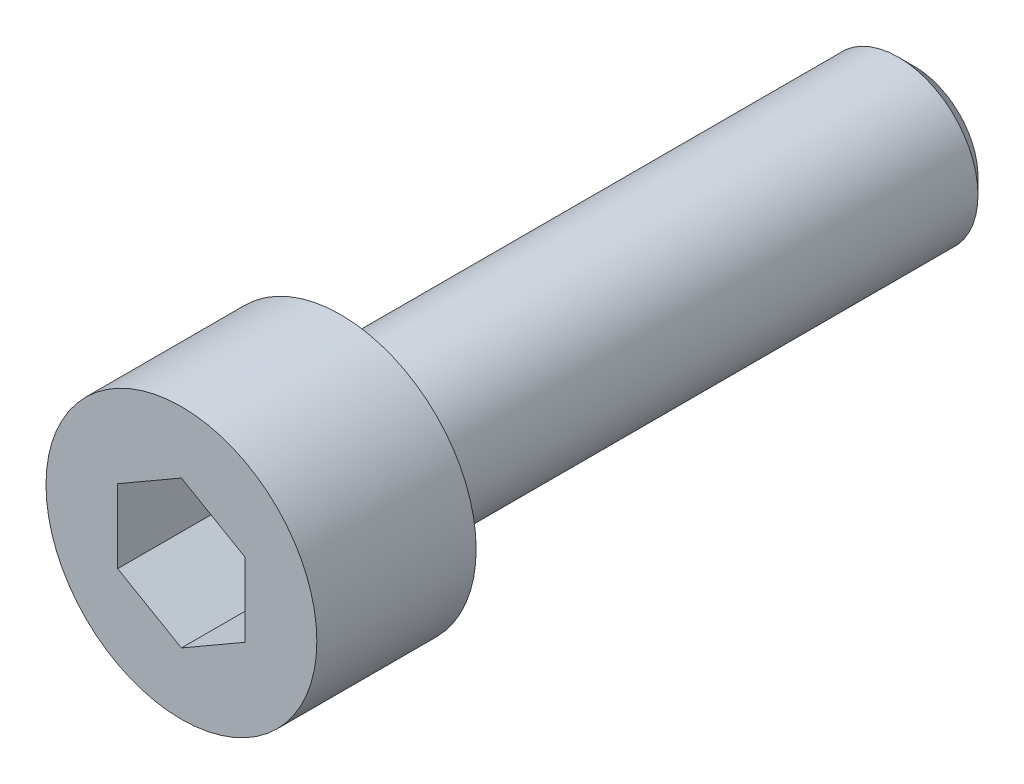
ISO-10303-21;
HEADER;
FILE_DESCRIPTION(('STEP AP214'),'2;1');
FILE_NAME('part.step','',(''),(''),'','','');
FILE_SCHEMA(('AUTOMOTIVE_DESIGN { 1 0 10303 214 1 1 1 1 }'));
ENDSEC;
DATA;
#1=APPLICATION_CONTEXT('core data for automotive mechanical design processes');
#2=APPLICATION_PROTOCOL_DEFINITION('international standard','automotive_design',2000,#1);
#3=PRODUCT_CONTEXT('',#1,'mechanical');
#4=PRODUCT('Part','Part','',(#3));
#5=PRODUCT_RELATED_PRODUCT_CATEGORY('part','',(#4));
#6=PRODUCT_DEFINITION_FORMATION('','',#4);
#7=PRODUCT_DEFINITION_CONTEXT('part definition',#1,'design');
#8=PRODUCT_DEFINITION('design','',#6,#7);
#9=PRODUCT_DEFINITION_SHAPE('','',#8);
#10=(LENGTH_UNIT() NAMED_UNIT(*) SI_UNIT(.MILLI.,.METRE.));
#11=(NAMED_UNIT(*) PLANE_ANGLE_UNIT() SI_UNIT($,.RADIAN.));
#12=(NAMED_UNIT(*) SI_UNIT($,.STERADIAN.) SOLID_ANGLE_UNIT());
#13=UNCERTAINTY_MEASURE_WITH_UNIT(LENGTH_MEASURE(1.E-05),#10,'distance_accuracy_value','');
#14=(GEOMETRIC_REPRESENTATION_CONTEXT(3) GLOBAL_UNCERTAINTY_ASSIGNED_CONTEXT((#13)) GLOBAL_UNIT_ASSIGNED_CONTEXT((#10,
#11,#12)) REPRESENTATION_CONTEXT('',''));
#15=CARTESIAN_POINT('',(0.,0.,0.));
#16=DIRECTION('',(0.,0.,1.));
#17=DIRECTION('',(1.,0.,0.));
#18=AXIS2_PLACEMENT_3D('',#15,#16,#17);
#19=CARTESIAN_POINT('',(0.,0.,-5.));
#20=DIRECTION('',(0.,0.,1.));
#21=DIRECTION('',(1.,0.,0.));
#22=AXIS2_PLACEMENT_3D('',#19,#20,#21);
#23=PLANE('',#22);
#24=CARTESIAN_POINT('',(0.,0.,-5.));
#25=DIRECTION('',(0.,0.,1.));
#26=DIRECTION('',(1.,0.,0.));
#27=AXIS2_PLACEMENT_3D('',#24,#25,#26);
#28=CIRCLE('',#27,4.25);
#29=CARTESIAN_POINT('',(4.25,0.,-5.));
#30=VERTEX_POINT('',#29);
#31=EDGE_CURVE('E143',#30,#30,#28,.T.);
#32=ORIENTED_EDGE('',*,*,#31,.F.);
#33=EDGE_LOOP('',(#32));
#34=FACE_BOUND('',#33,.T.);
#35=CARTESIAN_POINT('',(0.,0.,-5.));
#36=DIRECTION('',(0.,0.,1.));
#37=DIRECTION('',(1.,0.,0.));
#38=AXIS2_PLACEMENT_3D('',#35,#36,#37);
#39=CIRCLE('',#38,2.5);
#40=CARTESIAN_POINT('',(2.5,0.,-5.));
#41=VERTEX_POINT('',#40);
#42=EDGE_CURVE('E146',#41,#41,#39,.F.);
#43=ORIENTED_EDGE('',*,*,#42,.F.);
#44=EDGE_LOOP('',(#43));
#45=FACE_BOUND('',#44,.T.);
#46=ADVANCED_FACE('F31',(#34,#45),#23,.F.);
#47=CARTESIAN_POINT('',(0.,0.,-5.));
#48=DIRECTION('',(0.,0.,1.));
#49=DIRECTION('',(1.,0.,0.));
#50=AXIS2_PLACEMENT_3D('',#47,#48,#49);
#51=CYLINDRICAL_SURFACE('',#50,4.25);
#52=ORIENTED_EDGE('',*,*,#31,.T.);
#53=EDGE_LOOP('',(#52));
#54=FACE_BOUND('',#53,.T.);
#55=CARTESIAN_POINT('',(0.,0.,0.));
#56=DIRECTION('',(0.,0.,1.));
#57=DIRECTION('',(1.,0.,0.));
#58=AXIS2_PLACEMENT_3D('',#55,#56,#57);
#59=CIRCLE('',#58,4.25);
#60=CARTESIAN_POINT('',(4.25,0.,0.));
#61=VERTEX_POINT('',#60);
#62=EDGE_CURVE('E134',#61,#61,#59,.T.);
#63=ORIENTED_EDGE('',*,*,#62,.F.);
#64=EDGE_LOOP('',(#63));
#65=FACE_BOUND('',#64,.T.);
#66=ADVANCED_FACE('F33',(#54,#65),#51,.T.);
#67=CARTESIAN_POINT('',(0.,0.,0.));
#68=DIRECTION('',(0.,0.,1.));
#69=DIRECTION('',(1.,0.,0.));
#70=AXIS2_PLACEMENT_3D('',#67,#68,#69);
#71=PLANE('',#70);
#72=DIRECTION('',(0.866025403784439,0.5,0.));
#73=VECTOR('',#72,1.);
#74=CARTESIAN_POINT('',(0.,-2.3094010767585,0.));
#75=LINE('',#74,#73);
#76=CARTESIAN_POINT('',(0.,-2.3094010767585,0.));
#77=VERTEX_POINT('',#76);
#78=CARTESIAN_POINT('',(2.,-1.15470053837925,0.));
#79=VERTEX_POINT('',#78);
#80=EDGE_CURVE('E46',#77,#79,#75,.T.);
#81=ORIENTED_EDGE('',*,*,#80,.F.);
#82=DIRECTION('',(0.866025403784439,-0.5,0.));
#83=VECTOR('',#82,1.);
#84=CARTESIAN_POINT('',(-2.,-1.15470053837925,0.));
#85=LINE('',#84,#83);
#86=CARTESIAN_POINT('',(-2.,-1.15470053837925,0.));
#87=VERTEX_POINT('',#86);
#88=EDGE_CURVE('E116',#87,#77,#85,.T.);
#89=ORIENTED_EDGE('',*,*,#88,.F.);
#90=DIRECTION('',(0.,-1.,0.));
#91=VECTOR('',#90,1.);
#92=CARTESIAN_POINT('',(-2.,1.15470053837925,0.));
#93=LINE('',#92,#91);
#94=CARTESIAN_POINT('',(-2.,1.15470053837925,0.));
#95=VERTEX_POINT('',#94);
#96=EDGE_CURVE('E110',#95,#87,#93,.T.);
#97=ORIENTED_EDGE('',*,*,#96,.F.);
#98=DIRECTION('',(-0.866025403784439,-0.5,0.));
#99=VECTOR('',#98,1.);
#100=CARTESIAN_POINT('',(0.,2.3094010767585,0.));
#101=LINE('',#100,#99);
#102=CARTESIAN_POINT('',(0.,2.3094010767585,0.));
#103=VERTEX_POINT('',#102);
#104=EDGE_CURVE('E108',#103,#95,#101,.T.);
#105=ORIENTED_EDGE('',*,*,#104,.F.);
#106=DIRECTION('',(-0.866025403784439,0.5,0.));
#107=VECTOR('',#106,1.);
#108=CARTESIAN_POINT('',(2.,1.15470053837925,0.));
#109=LINE('',#108,#107);
#110=CARTESIAN_POINT('',(2.,1.15470053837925,0.));
#111=VERTEX_POINT('',#110);
#112=EDGE_CURVE('E89',#111,#103,#109,.T.);
#113=ORIENTED_EDGE('',*,*,#112,.F.);
#114=DIRECTION('',(0.,1.,0.));
#115=VECTOR('',#114,1.);
#116=CARTESIAN_POINT('',(2.,-1.15470053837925,0.));
#117=LINE('',#116,#115);
#118=EDGE_CURVE('E100',#79,#111,#117,.T.);
#119=ORIENTED_EDGE('',*,*,#118,.F.);
#120=EDGE_LOOP('',(#81,#89,#97,#105,#113,#119));
#121=FACE_BOUND('',#120,.T.);
#122=ORIENTED_EDGE('',*,*,#62,.T.);
#123=EDGE_LOOP('',(#122));
#124=FACE_BOUND('',#123,.T.);
#125=ADVANCED_FACE('F104',(#121,#124),#71,.T.);
#126=CARTESIAN_POINT('',(0.,0.,-23.));
#127=DIRECTION('',(0.,0.,1.));
#128=DIRECTION('',(1.,0.,0.));
#129=AXIS2_PLACEMENT_3D('',#126,#127,#128);
#130=CYLINDRICAL_SURFACE('',#129,2.5);
#131=CARTESIAN_POINT('',(0.,0.,-22.5));
#132=DIRECTION('',(0.,0.,-1.));
#133=DIRECTION('',(-1.,0.,0.));
#134=AXIS2_PLACEMENT_3D('',#131,#132,#133);
#135=CIRCLE('',#134,2.5);
#136=CARTESIAN_POINT('',(-2.5,0.,-22.5));
#137=VERTEX_POINT('',#136);
#138=EDGE_CURVE('E11',#137,#137,#135,.F.);
#139=ORIENTED_EDGE('',*,*,#138,.T.);
#140=EDGE_LOOP('',(#139));
#141=FACE_BOUND('',#140,.T.);
#142=ORIENTED_EDGE('',*,*,#42,.T.);
#143=EDGE_LOOP('',(#142));
#144=FACE_BOUND('',#143,.T.);
#145=ADVANCED_FACE('F175',(#141,#144),#130,.T.);
#146=CARTESIAN_POINT('',(0.,0.,-23.));
#147=DIRECTION('',(0.,0.,-1.));
#148=DIRECTION('',(-1.,0.,0.));
#149=AXIS2_PLACEMENT_3D('',#146,#147,#148);
#150=PLANE('',#149);
#151=CARTESIAN_POINT('',(0.,0.,-23.));
#152=DIRECTION('',(0.,0.,-1.));
#153=DIRECTION('',(-1.,0.,0.));
#154=AXIS2_PLACEMENT_3D('',#151,#152,#153);
#155=CIRCLE('',#154,2.);
#156=CARTESIAN_POINT('',(-2.,0.,-23.));
#157=VERTEX_POINT('',#156);
#158=EDGE_CURVE('E39',#157,#157,#155,.T.);
#159=ORIENTED_EDGE('',*,*,#158,.T.);
#160=EDGE_LOOP('',(#159));
#161=FACE_BOUND('',#160,.T.);
#162=ADVANCED_FACE('F151',(#161),#150,.T.);
#163=CARTESIAN_POINT('',(0.,-2.3094010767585,-5.));
#164=DIRECTION('',(0.5,-0.866025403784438,0.));
#165=DIRECTION('',(0.866025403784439,0.5,0.));
#166=AXIS2_PLACEMENT_3D('',#163,#164,#165);
#167=PLANE('',#166);
#168=ORIENTED_EDGE('',*,*,#80,.T.);
#169=DIRECTION('',(0.,0.,1.));
#170=VECTOR('',#169,1.);
#171=CARTESIAN_POINT('',(2.,-1.15470053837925,-5.));
#172=LINE('',#171,#170);
#173=CARTESIAN_POINT('',(2.,-1.15470053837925,-5.));
#174=VERTEX_POINT('',#173);
#175=EDGE_CURVE('E97',#174,#79,#172,.T.);
#176=ORIENTED_EDGE('',*,*,#175,.F.);
#177=DIRECTION('',(0.866025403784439,0.5,0.));
#178=VECTOR('',#177,1.);
#179=CARTESIAN_POINT('',(0.,-2.3094010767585,-5.));
#180=LINE('',#179,#178);
#181=CARTESIAN_POINT('',(0.,-2.3094010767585,-5.));
#182=VERTEX_POINT('',#181);
#183=EDGE_CURVE('E118',#182,#174,#180,.T.);
#184=ORIENTED_EDGE('',*,*,#183,.F.);
#185=DIRECTION('',(0.,0.,1.));
#186=VECTOR('',#185,1.);
#187=CARTESIAN_POINT('',(0.,-2.3094010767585,-5.));
#188=LINE('',#187,#186);
#189=EDGE_CURVE('E53',#182,#77,#188,.T.);
#190=ORIENTED_EDGE('',*,*,#189,.T.);
#191=EDGE_LOOP('',(#168,#176,#184,#190));
#192=FACE_BOUND('',#191,.T.);
#193=ADVANCED_FACE('F181',(#192),#167,.F.);
#194=CARTESIAN_POINT('',(-2.,-1.15470053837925,-5.));
#195=DIRECTION('',(-0.5,-0.866025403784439,0.));
#196=DIRECTION('',(0.866025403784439,-0.5,0.));
#197=AXIS2_PLACEMENT_3D('',#194,#195,#196);
#198=PLANE('',#197);
#199=ORIENTED_EDGE('',*,*,#88,.T.);
#200=ORIENTED_EDGE('',*,*,#189,.F.);
#201=DIRECTION('',(0.866025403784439,-0.5,0.));
#202=VECTOR('',#201,1.);
#203=CARTESIAN_POINT('',(-2.,-1.15470053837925,-5.));
#204=LINE('',#203,#202);
#205=CARTESIAN_POINT('',(-2.,-1.15470053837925,-5.));
#206=VERTEX_POINT('',#205);
#207=EDGE_CURVE('E130',#206,#182,#204,.T.);
#208=ORIENTED_EDGE('',*,*,#207,.F.);
#209=DIRECTION('',(0.,0.,1.));
#210=VECTOR('',#209,1.);
#211=CARTESIAN_POINT('',(-2.,-1.15470053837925,-5.));
#212=LINE('',#211,#210);
#213=EDGE_CURVE('E135',#206,#87,#212,.T.);
#214=ORIENTED_EDGE('',*,*,#213,.T.);
#215=EDGE_LOOP('',(#199,#200,#208,#214));
#216=FACE_BOUND('',#215,.T.);
#217=ADVANCED_FACE('F184',(#216),#198,.F.);
#218=CARTESIAN_POINT('',(-2.,1.15470053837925,-5.));
#219=DIRECTION('',(-1.,0.,0.));
#220=DIRECTION('',(0.,0.,1.));
#221=AXIS2_PLACEMENT_3D('',#218,#219,#220);
#222=PLANE('',#221);
#223=ORIENTED_EDGE('',*,*,#96,.T.);
#224=ORIENTED_EDGE('',*,*,#213,.F.);
#225=DIRECTION('',(0.,-1.,0.));
#226=VECTOR('',#225,1.);
#227=CARTESIAN_POINT('',(-2.,1.15470053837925,-5.));
#228=LINE('',#227,#226);
#229=CARTESIAN_POINT('',(-2.,1.15470053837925,-5.));
#230=VERTEX_POINT('',#229);
#231=EDGE_CURVE('E127',#230,#206,#228,.T.);
#232=ORIENTED_EDGE('',*,*,#231,.F.);
#233=DIRECTION('',(0.,0.,1.));
#234=VECTOR('',#233,1.);
#235=CARTESIAN_POINT('',(-2.,1.15470053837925,-5.));
#236=LINE('',#235,#234);
#237=EDGE_CURVE('E137',#230,#95,#236,.T.);
#238=ORIENTED_EDGE('',*,*,#237,.T.);
#239=EDGE_LOOP('',(#223,#224,#232,#238));
#240=FACE_BOUND('',#239,.T.);
#241=ADVANCED_FACE('F192',(#240),#222,.F.);
#242=CARTESIAN_POINT('',(0.,2.3094010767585,-5.));
#243=DIRECTION('',(-0.5,0.866025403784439,0.));
#244=DIRECTION('',(-0.866025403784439,-0.5,0.));
#245=AXIS2_PLACEMENT_3D('',#242,#243,#244);
#246=PLANE('',#245);
#247=ORIENTED_EDGE('',*,*,#104,.T.);
#248=ORIENTED_EDGE('',*,*,#237,.F.);
#249=DIRECTION('',(-0.866025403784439,-0.5,0.));
#250=VECTOR('',#249,1.);
#251=CARTESIAN_POINT('',(0.,2.3094010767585,-5.));
#252=LINE('',#251,#250);
#253=CARTESIAN_POINT('',(0.,2.3094010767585,-5.));
#254=VERTEX_POINT('',#253);
#255=EDGE_CURVE('E124',#254,#230,#252,.T.);
#256=ORIENTED_EDGE('',*,*,#255,.F.);
#257=DIRECTION('',(0.,0.,1.));
#258=VECTOR('',#257,1.);
#259=CARTESIAN_POINT('',(0.,2.3094010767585,-5.));
#260=LINE('',#259,#258);
#261=EDGE_CURVE('E96',#254,#103,#260,.T.);
#262=ORIENTED_EDGE('',*,*,#261,.T.);
#263=EDGE_LOOP('',(#247,#248,#256,#262));
#264=FACE_BOUND('',#263,.T.);
#265=ADVANCED_FACE('F189',(#264),#246,.F.);
#266=CARTESIAN_POINT('',(2.,1.15470053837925,-5.));
#267=DIRECTION('',(0.5,0.866025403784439,0.));
#268=DIRECTION('',(-0.866025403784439,0.5,0.));
#269=AXIS2_PLACEMENT_3D('',#266,#267,#268);
#270=PLANE('',#269);
#271=ORIENTED_EDGE('',*,*,#112,.T.);
#272=ORIENTED_EDGE('',*,*,#261,.F.);
#273=DIRECTION('',(-0.866025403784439,0.5,0.));
#274=VECTOR('',#273,1.);
#275=CARTESIAN_POINT('',(2.,1.15470053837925,-5.));
#276=LINE('',#275,#274);
#277=CARTESIAN_POINT('',(2.,1.15470053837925,-5.));
#278=VERTEX_POINT('',#277);
#279=EDGE_CURVE('E92',#278,#254,#276,.T.);
#280=ORIENTED_EDGE('',*,*,#279,.F.);
#281=DIRECTION('',(0.,0.,1.));
#282=VECTOR('',#281,1.);
#283=CARTESIAN_POINT('',(2.,1.15470053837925,-5.));
#284=LINE('',#283,#282);
#285=EDGE_CURVE('E85',#278,#111,#284,.T.);
#286=ORIENTED_EDGE('',*,*,#285,.T.);
#287=EDGE_LOOP('',(#271,#272,#280,#286));
#288=FACE_BOUND('',#287,.T.);
#289=ADVANCED_FACE('F87',(#288),#270,.F.);
#290=CARTESIAN_POINT('',(2.,-1.15470053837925,-5.));
#291=DIRECTION('',(1.,0.,0.));
#292=DIRECTION('',(0.,0.,-1.));
#293=AXIS2_PLACEMENT_3D('',#290,#291,#292);
#294=PLANE('',#293);
#295=ORIENTED_EDGE('',*,*,#118,.T.);
#296=ORIENTED_EDGE('',*,*,#285,.F.);
#297=DIRECTION('',(0.,1.,0.));
#298=VECTOR('',#297,1.);
#299=CARTESIAN_POINT('',(2.,-1.15470053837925,-5.));
#300=LINE('',#299,#298);
#301=EDGE_CURVE('E121',#174,#278,#300,.T.);
#302=ORIENTED_EDGE('',*,*,#301,.F.);
#303=ORIENTED_EDGE('',*,*,#175,.T.);
#304=EDGE_LOOP('',(#295,#296,#302,#303));
#305=FACE_BOUND('',#304,.T.);
#306=ADVANCED_FACE('F101',(#305),#294,.F.);
#307=CARTESIAN_POINT('',(4.,0.,-5.));
#308=DIRECTION('',(0.,0.,1.));
#309=DIRECTION('',(1.,0.,0.));
#310=AXIS2_PLACEMENT_3D('',#307,#308,#309);
#311=PLANE('',#310);
#312=ORIENTED_EDGE('',*,*,#183,.T.);
#313=ORIENTED_EDGE('',*,*,#301,.T.);
#314=ORIENTED_EDGE('',*,*,#279,.T.);
#315=ORIENTED_EDGE('',*,*,#255,.T.);
#316=ORIENTED_EDGE('',*,*,#231,.T.);
#317=ORIENTED_EDGE('',*,*,#207,.T.);
#318=EDGE_LOOP('',(#312,#313,#314,#315,#316,#317));
#319=FACE_BOUND('',#318,.T.);
#320=ADVANCED_FACE('F155',(#319),#311,.T.);
#321=CARTESIAN_POINT('',(0.,0.,-23.));
#322=DIRECTION('',(0.,0.,1.));
#323=DIRECTION('',(1.,0.,0.));
#324=AXIS2_PLACEMENT_3D('',#321,#322,#323);
#325=CONICAL_SURFACE('',#324,2.,0.785398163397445);
#326=ORIENTED_EDGE('',*,*,#138,.F.);
#327=EDGE_LOOP('',(#326));
#328=FACE_BOUND('',#327,.T.);
#329=ORIENTED_EDGE('',*,*,#158,.F.);
#330=EDGE_LOOP('',(#329));
#331=FACE_BOUND('',#330,.T.);
#332=ADVANCED_FACE('F153',(#328,#331),#325,.T.);
#333=CLOSED_SHELL('',(#46,#66,#125,#145,#162,#193,#217,#241,#265,#289,#306,#320,#332));
#334=MANIFOLD_SOLID_BREP('B2',#333);
#335=ADVANCED_BREP_SHAPE_REPRESENTATION('',(#18,#334),#14);
#336=SHAPE_DEFINITION_REPRESENTATION(#9,#335);
ENDSEC;
END-ISO-10303-21;
